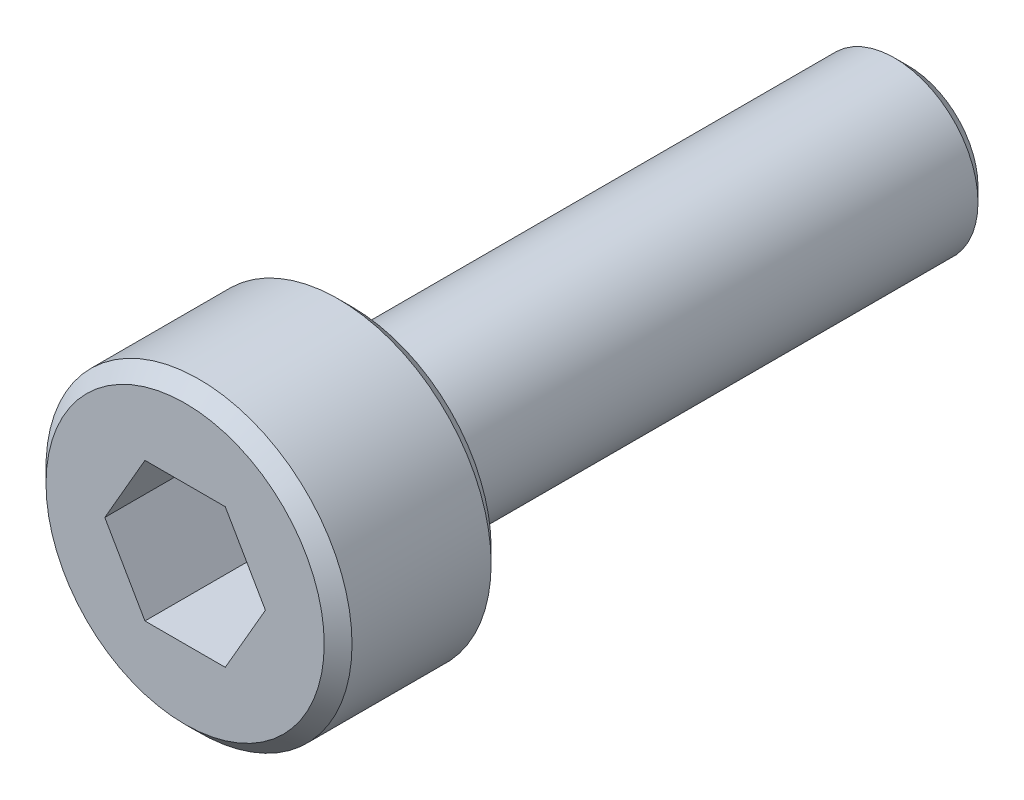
from build123d import *

# Parameters (mm, degrees)
SKETCH1_R           = 1.5
BOSS_EXTRUDE1_DEPTH = 10
SKETCH2_R           = 2.75
BOSS_EXTRUDE2_DEPTH = 3
CHAMFER1_SIZE       = 0.25
CUT_EXTRUDE1_DEPTH  = 2


with BuildPart() as part:
    # Sketch1 → Boss-Extrude1 (new body)
    with BuildSketch(Plane(origin=(0, 0, 0), x_dir=(0, 1, 0), z_dir=(0, 0, 1))):
        with Locations(Location((0, 0, 0), (0, 0, 270))):
            Circle(SKETCH1_R)
    extrude(amount=BOSS_EXTRUDE1_DEPTH)

    # Sketch2 → Boss-Extrude2 (add)
    with BuildSketch(Plane.XY.offset(10)):
        Circle(SKETCH2_R)
    extrude(amount=BOSS_EXTRUDE2_DEPTH)

    # Chamfer1
    chamfer1_edges = [part.edges().sort_by_distance(p)[0] for p in [
        (-1.5, 0, 0),
        (-2.75, 0, 10),
        (-2.75, 0, 13),
    ]]
    chamfer(chamfer1_edges, length=CHAMFER1_SIZE)

    # Sketch3 → Cut-Extrude1 (cut)
    with BuildSketch(Plane.XY.offset(13)):
        Polygon((1.443375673, 0), (0.721687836, 1.25), (-0.721687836, 1.25), (-1.443375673, 0), (-0.721687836, -1.25), (0.721687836, -1.25), align=None)
    extrude(amount=-CUT_EXTRUDE1_DEPTH, mode=Mode.SUBTRACT)


solid = part.part
